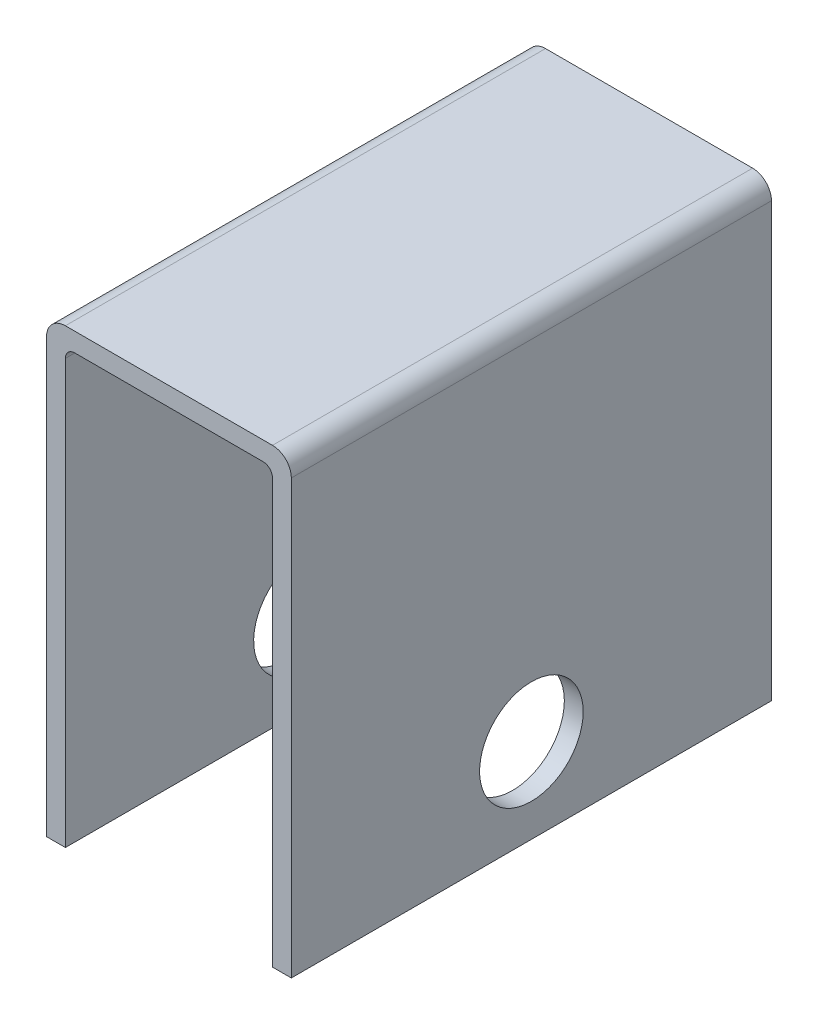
ISO-10303-21;
HEADER;
FILE_DESCRIPTION(('STEP AP214'),'2;1');
FILE_NAME('part.step','',(''),(''),'','','');
FILE_SCHEMA(('AUTOMOTIVE_DESIGN { 1 0 10303 214 1 1 1 1 }'));
ENDSEC;
DATA;
#1=APPLICATION_CONTEXT('core data for automotive mechanical design processes');
#2=APPLICATION_PROTOCOL_DEFINITION('international standard','automotive_design',2000,#1);
#3=PRODUCT_CONTEXT('',#1,'mechanical');
#4=PRODUCT('Part','Part','',(#3));
#5=PRODUCT_RELATED_PRODUCT_CATEGORY('part','',(#4));
#6=PRODUCT_DEFINITION_FORMATION('','',#4);
#7=PRODUCT_DEFINITION_CONTEXT('part definition',#1,'design');
#8=PRODUCT_DEFINITION('design','',#6,#7);
#9=PRODUCT_DEFINITION_SHAPE('','',#8);
#10=(LENGTH_UNIT() NAMED_UNIT(*) SI_UNIT(.MILLI.,.METRE.));
#11=(NAMED_UNIT(*) PLANE_ANGLE_UNIT() SI_UNIT($,.RADIAN.));
#12=(NAMED_UNIT(*) SI_UNIT($,.STERADIAN.) SOLID_ANGLE_UNIT());
#13=UNCERTAINTY_MEASURE_WITH_UNIT(LENGTH_MEASURE(1.E-05),#10,'distance_accuracy_value','');
#14=(GEOMETRIC_REPRESENTATION_CONTEXT(3) GLOBAL_UNCERTAINTY_ASSIGNED_CONTEXT((#13)) GLOBAL_UNIT_ASSIGNED_CONTEXT((#10,
#11,#12)) REPRESENTATION_CONTEXT('',''));
#15=CARTESIAN_POINT('',(0.,0.,0.));
#16=DIRECTION('',(0.,0.,1.));
#17=DIRECTION('',(1.,0.,0.));
#18=AXIS2_PLACEMENT_3D('',#15,#16,#17);
#19=CARTESIAN_POINT('',(0.,-240.,255.));
#20=DIRECTION('',(1.,0.,0.));
#21=DIRECTION('',(0.,0.,-1.));
#22=AXIS2_PLACEMENT_3D('',#19,#20,#21);
#23=PLANE('',#22);
#24=CARTESIAN_POINT('',(0.,-195.,127.5));
#25=DIRECTION('',(1.,0.,0.));
#26=DIRECTION('',(0.,0.,-1.));
#27=AXIS2_PLACEMENT_3D('',#24,#25,#26);
#28=CIRCLE('',#27,27.5);
#29=CARTESIAN_POINT('',(0.,-195.,100.));
#30=VERTEX_POINT('',#29);
#31=EDGE_CURVE('E258',#30,#30,#28,.T.);
#32=ORIENTED_EDGE('',*,*,#31,.T.);
#33=EDGE_LOOP('',(#32));
#34=FACE_BOUND('',#33,.T.);
#35=DIRECTION('',(0.,-1.,0.));
#36=VECTOR('',#35,1.);
#37=CARTESIAN_POINT('',(0.,-240.,255.));
#38=LINE('',#37,#36);
#39=CARTESIAN_POINT('',(0.,-10.,255.));
#40=VERTEX_POINT('',#39);
#41=CARTESIAN_POINT('',(0.,-240.,255.));
#42=VERTEX_POINT('',#41);
#43=EDGE_CURVE('E123',#40,#42,#38,.T.);
#44=ORIENTED_EDGE('',*,*,#43,.F.);
#45=DIRECTION('',(0.,0.,-1.));
#46=VECTOR('',#45,1.);
#47=CARTESIAN_POINT('',(0.,-10.,255.));
#48=LINE('',#47,#46);
#49=CARTESIAN_POINT('',(0.,-10.,0.));
#50=VERTEX_POINT('',#49);
#51=EDGE_CURVE('E148',#40,#50,#48,.T.);
#52=ORIENTED_EDGE('',*,*,#51,.T.);
#53=DIRECTION('',(0.,-1.,0.));
#54=VECTOR('',#53,1.);
#55=CARTESIAN_POINT('',(0.,-240.,0.));
#56=LINE('',#55,#54);
#57=CARTESIAN_POINT('',(0.,-240.,0.));
#58=VERTEX_POINT('',#57);
#59=EDGE_CURVE('E146',#50,#58,#56,.T.);
#60=ORIENTED_EDGE('',*,*,#59,.T.);
#61=DIRECTION('',(0.,0.,-1.));
#62=VECTOR('',#61,1.);
#63=CARTESIAN_POINT('',(0.,-240.,255.));
#64=LINE('',#63,#62);
#65=EDGE_CURVE('E140',#42,#58,#64,.T.);
#66=ORIENTED_EDGE('',*,*,#65,.F.);
#67=EDGE_LOOP('',(#44,#52,#60,#66));
#68=FACE_BOUND('',#67,.T.);
#69=ADVANCED_FACE('F35',(#34,#68),#23,.F.);
#70=CARTESIAN_POINT('',(10.,-240.,255.));
#71=DIRECTION('',(0.,1.,0.));
#72=DIRECTION('',(0.,0.,1.));
#73=AXIS2_PLACEMENT_3D('',#70,#71,#72);
#74=PLANE('',#73);
#75=DIRECTION('',(1.,0.,0.));
#76=VECTOR('',#75,1.);
#77=CARTESIAN_POINT('',(10.,-240.,0.));
#78=LINE('',#77,#76);
#79=CARTESIAN_POINT('',(10.,-240.,0.));
#80=VERTEX_POINT('',#79);
#81=EDGE_CURVE('E211',#58,#80,#78,.T.);
#82=ORIENTED_EDGE('',*,*,#81,.T.);
#83=DIRECTION('',(0.,0.,-1.));
#84=VECTOR('',#83,1.);
#85=CARTESIAN_POINT('',(10.,-240.,255.));
#86=LINE('',#85,#84);
#87=CARTESIAN_POINT('',(10.,-240.,255.));
#88=VERTEX_POINT('',#87);
#89=EDGE_CURVE('E142',#88,#80,#86,.T.);
#90=ORIENTED_EDGE('',*,*,#89,.F.);
#91=DIRECTION('',(1.,0.,0.));
#92=VECTOR('',#91,1.);
#93=CARTESIAN_POINT('',(10.,-240.,255.));
#94=LINE('',#93,#92);
#95=EDGE_CURVE('E127',#42,#88,#94,.T.);
#96=ORIENTED_EDGE('',*,*,#95,.F.);
#97=ORIENTED_EDGE('',*,*,#65,.T.);
#98=EDGE_LOOP('',(#82,#90,#96,#97));
#99=FACE_BOUND('',#98,.T.);
#100=ADVANCED_FACE('F139',(#99),#74,.F.);
#101=CARTESIAN_POINT('',(10.,-240.,255.));
#102=DIRECTION('',(-1.,0.,0.));
#103=DIRECTION('',(0.,-1.,0.));
#104=AXIS2_PLACEMENT_3D('',#101,#102,#103);
#105=PLANE('',#104);
#106=CARTESIAN_POINT('',(10.,-195.,127.5));
#107=DIRECTION('',(-1.,0.,0.));
#108=DIRECTION('',(0.,-1.,0.));
#109=AXIS2_PLACEMENT_3D('',#106,#107,#108);
#110=CIRCLE('',#109,27.5);
#111=CARTESIAN_POINT('',(10.,-222.5,127.5));
#112=VERTEX_POINT('',#111);
#113=EDGE_CURVE('E247',#112,#112,#110,.T.);
#114=ORIENTED_EDGE('',*,*,#113,.T.);
#115=EDGE_LOOP('',(#114));
#116=FACE_BOUND('',#115,.T.);
#117=DIRECTION('',(0.,1.,0.));
#118=VECTOR('',#117,1.);
#119=CARTESIAN_POINT('',(10.,-240.,0.));
#120=LINE('',#119,#118);
#121=CARTESIAN_POINT('',(10.,-15.,0.));
#122=VERTEX_POINT('',#121);
#123=EDGE_CURVE('E207',#80,#122,#120,.T.);
#124=ORIENTED_EDGE('',*,*,#123,.T.);
#125=DIRECTION('',(0.,0.,-1.));
#126=VECTOR('',#125,1.);
#127=CARTESIAN_POINT('',(10.,-15.,255.));
#128=LINE('',#127,#126);
#129=CARTESIAN_POINT('',(10.,-15.,255.));
#130=VERTEX_POINT('',#129);
#131=EDGE_CURVE('E50',#122,#130,#128,.F.);
#132=ORIENTED_EDGE('',*,*,#131,.T.);
#133=DIRECTION('',(0.,1.,0.));
#134=VECTOR('',#133,1.);
#135=CARTESIAN_POINT('',(10.,-240.,255.));
#136=LINE('',#135,#134);
#137=EDGE_CURVE('E143',#88,#130,#136,.T.);
#138=ORIENTED_EDGE('',*,*,#137,.F.);
#139=ORIENTED_EDGE('',*,*,#89,.T.);
#140=EDGE_LOOP('',(#124,#132,#138,#139));
#141=FACE_BOUND('',#140,.T.);
#142=ADVANCED_FACE('F248',(#116,#141),#105,.F.);
#143=CARTESIAN_POINT('',(120.,-10.,255.));
#144=DIRECTION('',(0.,1.,0.));
#145=DIRECTION('',(-1.,0.,0.));
#146=AXIS2_PLACEMENT_3D('',#143,#144,#145);
#147=PLANE('',#146);
#148=DIRECTION('',(1.,0.,0.));
#149=VECTOR('',#148,1.);
#150=CARTESIAN_POINT('',(120.,-10.,0.));
#151=LINE('',#150,#149);
#152=CARTESIAN_POINT('',(15.,-10.,0.));
#153=VERTEX_POINT('',#152);
#154=CARTESIAN_POINT('',(115.,-10.,0.));
#155=VERTEX_POINT('',#154);
#156=EDGE_CURVE('E201',#153,#155,#151,.T.);
#157=ORIENTED_EDGE('',*,*,#156,.T.);
#158=DIRECTION('',(0.,0.,-1.));
#159=VECTOR('',#158,1.);
#160=CARTESIAN_POINT('',(115.,-10.,255.));
#161=LINE('',#160,#159);
#162=CARTESIAN_POINT('',(115.,-10.,255.));
#163=VERTEX_POINT('',#162);
#164=EDGE_CURVE('E175',#155,#163,#161,.F.);
#165=ORIENTED_EDGE('',*,*,#164,.T.);
#166=DIRECTION('',(1.,0.,0.));
#167=VECTOR('',#166,1.);
#168=CARTESIAN_POINT('',(120.,-10.,255.));
#169=LINE('',#168,#167);
#170=CARTESIAN_POINT('',(15.,-10.,255.));
#171=VERTEX_POINT('',#170);
#172=EDGE_CURVE('E187',#171,#163,#169,.T.);
#173=ORIENTED_EDGE('',*,*,#172,.F.);
#174=DIRECTION('',(0.,0.,-1.));
#175=VECTOR('',#174,1.);
#176=CARTESIAN_POINT('',(15.,-10.,0.));
#177=LINE('',#176,#175);
#178=EDGE_CURVE('E172',#171,#153,#177,.T.);
#179=ORIENTED_EDGE('',*,*,#178,.T.);
#180=EDGE_LOOP('',(#157,#165,#173,#179));
#181=FACE_BOUND('',#180,.T.);
#182=ADVANCED_FACE('F205',(#181),#147,.F.);
#183=CARTESIAN_POINT('',(120.,-240.,255.));
#184=DIRECTION('',(1.,0.,0.));
#185=DIRECTION('',(0.,1.,0.));
#186=AXIS2_PLACEMENT_3D('',#183,#184,#185);
#187=PLANE('',#186);
#188=CARTESIAN_POINT('',(120.,-195.,127.5));
#189=DIRECTION('',(1.,0.,0.));
#190=DIRECTION('',(0.,1.,0.));
#191=AXIS2_PLACEMENT_3D('',#188,#189,#190);
#192=CIRCLE('',#191,27.5);
#193=CARTESIAN_POINT('',(120.,-167.5,127.5));
#194=VERTEX_POINT('',#193);
#195=EDGE_CURVE('E255',#194,#194,#192,.T.);
#196=ORIENTED_EDGE('',*,*,#195,.T.);
#197=EDGE_LOOP('',(#196));
#198=FACE_BOUND('',#197,.T.);
#199=DIRECTION('',(0.,-1.,0.));
#200=VECTOR('',#199,1.);
#201=CARTESIAN_POINT('',(120.,-240.,255.));
#202=LINE('',#201,#200);
#203=CARTESIAN_POINT('',(120.,-15.,255.));
#204=VERTEX_POINT('',#203);
#205=CARTESIAN_POINT('',(120.,-240.,255.));
#206=VERTEX_POINT('',#205);
#207=EDGE_CURVE('E184',#204,#206,#202,.T.);
#208=ORIENTED_EDGE('',*,*,#207,.F.);
#209=DIRECTION('',(0.,0.,-1.));
#210=VECTOR('',#209,1.);
#211=CARTESIAN_POINT('',(120.,-15.,0.));
#212=LINE('',#211,#210);
#213=CARTESIAN_POINT('',(120.,-15.,0.));
#214=VERTEX_POINT('',#213);
#215=EDGE_CURVE('E169',#204,#214,#212,.T.);
#216=ORIENTED_EDGE('',*,*,#215,.T.);
#217=DIRECTION('',(0.,-1.,0.));
#218=VECTOR('',#217,1.);
#219=CARTESIAN_POINT('',(120.,-240.,0.));
#220=LINE('',#219,#218);
#221=CARTESIAN_POINT('',(120.,-240.,0.));
#222=VERTEX_POINT('',#221);
#223=EDGE_CURVE('E203',#214,#222,#220,.T.);
#224=ORIENTED_EDGE('',*,*,#223,.T.);
#225=DIRECTION('',(0.,0.,-1.));
#226=VECTOR('',#225,1.);
#227=CARTESIAN_POINT('',(120.,-240.,255.));
#228=LINE('',#227,#226);
#229=EDGE_CURVE('E152',#206,#222,#228,.T.);
#230=ORIENTED_EDGE('',*,*,#229,.F.);
#231=EDGE_LOOP('',(#208,#216,#224,#230));
#232=FACE_BOUND('',#231,.T.);
#233=ADVANCED_FACE('F192',(#198,#232),#187,.F.);
#234=CARTESIAN_POINT('',(120.,-240.,255.));
#235=DIRECTION('',(0.,1.,0.));
#236=DIRECTION('',(0.,0.,1.));
#237=AXIS2_PLACEMENT_3D('',#234,#235,#236);
#238=PLANE('',#237);
#239=DIRECTION('',(1.,0.,0.));
#240=VECTOR('',#239,1.);
#241=CARTESIAN_POINT('',(120.,-240.,0.));
#242=LINE('',#241,#240);
#243=CARTESIAN_POINT('',(130.,-240.,0.));
#244=VERTEX_POINT('',#243);
#245=EDGE_CURVE('E209',#222,#244,#242,.T.);
#246=ORIENTED_EDGE('',*,*,#245,.T.);
#247=DIRECTION('',(0.,0.,-1.));
#248=VECTOR('',#247,1.);
#249=CARTESIAN_POINT('',(130.,-240.,255.));
#250=LINE('',#249,#248);
#251=CARTESIAN_POINT('',(130.,-240.,255.));
#252=VERTEX_POINT('',#251);
#253=EDGE_CURVE('E221',#252,#244,#250,.T.);
#254=ORIENTED_EDGE('',*,*,#253,.F.);
#255=DIRECTION('',(1.,0.,0.));
#256=VECTOR('',#255,1.);
#257=CARTESIAN_POINT('',(120.,-240.,255.));
#258=LINE('',#257,#256);
#259=EDGE_CURVE('E196',#206,#252,#258,.T.);
#260=ORIENTED_EDGE('',*,*,#259,.F.);
#261=ORIENTED_EDGE('',*,*,#229,.T.);
#262=EDGE_LOOP('',(#246,#254,#260,#261));
#263=FACE_BOUND('',#262,.T.);
#264=ADVANCED_FACE('F225',(#263),#238,.F.);
#265=CARTESIAN_POINT('',(130.,-240.,255.));
#266=DIRECTION('',(-1.,0.,0.));
#267=DIRECTION('',(0.,0.,1.));
#268=AXIS2_PLACEMENT_3D('',#265,#266,#267);
#269=PLANE('',#268);
#270=CARTESIAN_POINT('',(130.,-195.,127.5));
#271=DIRECTION('',(1.,0.,0.));
#272=DIRECTION('',(0.,0.,-1.));
#273=AXIS2_PLACEMENT_3D('',#270,#271,#272);
#274=CIRCLE('',#273,27.5);
#275=CARTESIAN_POINT('',(130.,-195.,100.));
#276=VERTEX_POINT('',#275);
#277=EDGE_CURVE('E259',#276,#276,#274,.T.);
#278=ORIENTED_EDGE('',*,*,#277,.F.);
#279=EDGE_LOOP('',(#278));
#280=FACE_BOUND('',#279,.T.);
#281=DIRECTION('',(0.,1.,0.));
#282=VECTOR('',#281,1.);
#283=CARTESIAN_POINT('',(130.,-240.,0.));
#284=LINE('',#283,#282);
#285=CARTESIAN_POINT('',(130.,-10.0000000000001,0.));
#286=VERTEX_POINT('',#285);
#287=EDGE_CURVE('E216',#244,#286,#284,.T.);
#288=ORIENTED_EDGE('',*,*,#287,.T.);
#289=DIRECTION('',(0.,0.,-1.));
#290=VECTOR('',#289,1.);
#291=CARTESIAN_POINT('',(130.,-10.,255.));
#292=LINE('',#291,#290);
#293=CARTESIAN_POINT('',(130.,-10.0000000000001,255.));
#294=VERTEX_POINT('',#293);
#295=EDGE_CURVE('E167',#286,#294,#292,.F.);
#296=ORIENTED_EDGE('',*,*,#295,.T.);
#297=DIRECTION('',(0.,1.,0.));
#298=VECTOR('',#297,1.);
#299=CARTESIAN_POINT('',(130.,-240.,255.));
#300=LINE('',#299,#298);
#301=EDGE_CURVE('E239',#252,#294,#300,.T.);
#302=ORIENTED_EDGE('',*,*,#301,.F.);
#303=ORIENTED_EDGE('',*,*,#253,.T.);
#304=EDGE_LOOP('',(#288,#296,#302,#303));
#305=FACE_BOUND('',#304,.T.);
#306=ADVANCED_FACE('F231',(#280,#305),#269,.F.);
#307=CARTESIAN_POINT('',(130.,0.,255.));
#308=DIRECTION('',(0.,-1.,0.));
#309=DIRECTION('',(1.,0.,0.));
#310=AXIS2_PLACEMENT_3D('',#307,#308,#309);
#311=PLANE('',#310);
#312=DIRECTION('',(-1.,0.,0.));
#313=VECTOR('',#312,1.);
#314=CARTESIAN_POINT('',(130.,0.,0.));
#315=LINE('',#314,#313);
#316=CARTESIAN_POINT('',(120.,0.,0.));
#317=VERTEX_POINT('',#316);
#318=CARTESIAN_POINT('',(10.,0.,0.));
#319=VERTEX_POINT('',#318);
#320=EDGE_CURVE('E135',#317,#319,#315,.T.);
#321=ORIENTED_EDGE('',*,*,#320,.T.);
#322=DIRECTION('',(0.,0.,-1.));
#323=VECTOR('',#322,1.);
#324=CARTESIAN_POINT('',(10.,0.,255.));
#325=LINE('',#324,#323);
#326=CARTESIAN_POINT('',(10.,0.,255.));
#327=VERTEX_POINT('',#326);
#328=EDGE_CURVE('E162',#319,#327,#325,.F.);
#329=ORIENTED_EDGE('',*,*,#328,.T.);
#330=DIRECTION('',(-1.,0.,0.));
#331=VECTOR('',#330,1.);
#332=CARTESIAN_POINT('',(130.,0.,255.));
#333=LINE('',#332,#331);
#334=CARTESIAN_POINT('',(120.,0.,255.));
#335=VERTEX_POINT('',#334);
#336=EDGE_CURVE('E223',#335,#327,#333,.T.);
#337=ORIENTED_EDGE('',*,*,#336,.F.);
#338=DIRECTION('',(0.,0.,-1.));
#339=VECTOR('',#338,1.);
#340=CARTESIAN_POINT('',(120.,0.,255.));
#341=LINE('',#340,#339);
#342=EDGE_CURVE('E159',#335,#317,#341,.T.);
#343=ORIENTED_EDGE('',*,*,#342,.T.);
#344=EDGE_LOOP('',(#321,#329,#337,#343));
#345=FACE_BOUND('',#344,.T.);
#346=ADVANCED_FACE('F241',(#345),#311,.F.);
#347=CARTESIAN_POINT('',(0.,0.,255.));
#348=DIRECTION('',(0.,0.,1.));
#349=DIRECTION('',(1.,0.,0.));
#350=AXIS2_PLACEMENT_3D('',#347,#348,#349);
#351=PLANE('',#350);
#352=ORIENTED_EDGE('',*,*,#336,.T.);
#353=CARTESIAN_POINT('',(10.,-10.,255.));
#354=DIRECTION('',(0.,0.,1.));
#355=DIRECTION('',(1.,0.,0.));
#356=AXIS2_PLACEMENT_3D('',#353,#354,#355);
#357=CIRCLE('',#356,10.);
#358=EDGE_CURVE('E130',#327,#40,#357,.T.);
#359=ORIENTED_EDGE('',*,*,#358,.T.);
#360=ORIENTED_EDGE('',*,*,#43,.T.);
#361=ORIENTED_EDGE('',*,*,#95,.T.);
#362=ORIENTED_EDGE('',*,*,#137,.T.);
#363=CARTESIAN_POINT('',(15.,-15.,255.));
#364=DIRECTION('',(0.,0.,1.));
#365=DIRECTION('',(1.,0.,0.));
#366=AXIS2_PLACEMENT_3D('',#363,#364,#365);
#367=CIRCLE('',#366,5.);
#368=EDGE_CURVE('E11',#130,#171,#367,.F.);
#369=ORIENTED_EDGE('',*,*,#368,.T.);
#370=ORIENTED_EDGE('',*,*,#172,.T.);
#371=CARTESIAN_POINT('',(115.,-15.,255.));
#372=DIRECTION('',(0.,0.,1.));
#373=DIRECTION('',(1.,0.,0.));
#374=AXIS2_PLACEMENT_3D('',#371,#372,#373);
#375=CIRCLE('',#374,5.);
#376=EDGE_CURVE('E180',#163,#204,#375,.F.);
#377=ORIENTED_EDGE('',*,*,#376,.T.);
#378=ORIENTED_EDGE('',*,*,#207,.T.);
#379=ORIENTED_EDGE('',*,*,#259,.T.);
#380=ORIENTED_EDGE('',*,*,#301,.T.);
#381=CARTESIAN_POINT('',(120.,-10.,255.));
#382=DIRECTION('',(0.,0.,1.));
#383=DIRECTION('',(1.,0.,0.));
#384=AXIS2_PLACEMENT_3D('',#381,#382,#383);
#385=CIRCLE('',#384,10.);
#386=EDGE_CURVE('E164',#294,#335,#385,.T.);
#387=ORIENTED_EDGE('',*,*,#386,.T.);
#388=EDGE_LOOP('',(#352,#359,#360,#361,#362,#369,#370,#377,#378,#379,#380,#387));
#389=FACE_BOUND('',#388,.T.);
#390=ADVANCED_FACE('F126',(#389),#351,.T.);
#391=CARTESIAN_POINT('',(0.,0.,0.));
#392=DIRECTION('',(0.,0.,1.));
#393=DIRECTION('',(1.,0.,0.));
#394=AXIS2_PLACEMENT_3D('',#391,#392,#393);
#395=PLANE('',#394);
#396=ORIENTED_EDGE('',*,*,#59,.F.);
#397=CARTESIAN_POINT('',(10.,-10.,0.));
#398=DIRECTION('',(0.,0.,1.));
#399=DIRECTION('',(1.,0.,0.));
#400=AXIS2_PLACEMENT_3D('',#397,#398,#399);
#401=CIRCLE('',#400,10.);
#402=EDGE_CURVE('E157',#50,#319,#401,.F.);
#403=ORIENTED_EDGE('',*,*,#402,.T.);
#404=ORIENTED_EDGE('',*,*,#320,.F.);
#405=CARTESIAN_POINT('',(120.,-10.,0.));
#406=DIRECTION('',(0.,0.,1.));
#407=DIRECTION('',(1.,0.,0.));
#408=AXIS2_PLACEMENT_3D('',#405,#406,#407);
#409=CIRCLE('',#408,10.);
#410=EDGE_CURVE('E150',#317,#286,#409,.F.);
#411=ORIENTED_EDGE('',*,*,#410,.T.);
#412=ORIENTED_EDGE('',*,*,#287,.F.);
#413=ORIENTED_EDGE('',*,*,#245,.F.);
#414=ORIENTED_EDGE('',*,*,#223,.F.);
#415=CARTESIAN_POINT('',(115.,-15.,0.));
#416=DIRECTION('',(0.,0.,1.));
#417=DIRECTION('',(1.,0.,0.));
#418=AXIS2_PLACEMENT_3D('',#415,#416,#417);
#419=CIRCLE('',#418,5.);
#420=EDGE_CURVE('E178',#214,#155,#419,.T.);
#421=ORIENTED_EDGE('',*,*,#420,.T.);
#422=ORIENTED_EDGE('',*,*,#156,.F.);
#423=CARTESIAN_POINT('',(15.,-15.,0.));
#424=DIRECTION('',(0.,0.,1.));
#425=DIRECTION('',(1.,0.,0.));
#426=AXIS2_PLACEMENT_3D('',#423,#424,#425);
#427=CIRCLE('',#426,5.);
#428=EDGE_CURVE('E43',#153,#122,#427,.T.);
#429=ORIENTED_EDGE('',*,*,#428,.T.);
#430=ORIENTED_EDGE('',*,*,#123,.F.);
#431=ORIENTED_EDGE('',*,*,#81,.F.);
#432=EDGE_LOOP('',(#396,#403,#404,#411,#412,#413,#414,#421,#422,#429,#430,#431));
#433=FACE_BOUND('',#432,.T.);
#434=ADVANCED_FACE('F200',(#433),#395,.F.);
#435=CARTESIAN_POINT('',(0.,-195.,127.5));
#436=DIRECTION('',(1.,0.,0.));
#437=DIRECTION('',(0.,0.,-1.));
#438=AXIS2_PLACEMENT_3D('',#435,#436,#437);
#439=CYLINDRICAL_SURFACE('',#438,27.5);
#440=ORIENTED_EDGE('',*,*,#277,.T.);
#441=EDGE_LOOP('',(#440));
#442=FACE_BOUND('',#441,.T.);
#443=ORIENTED_EDGE('',*,*,#195,.F.);
#444=EDGE_LOOP('',(#443));
#445=FACE_BOUND('',#444,.T.);
#446=ADVANCED_FACE('F270',(#442,#445),#439,.F.);
#447=ORIENTED_EDGE('',*,*,#31,.F.);
#448=EDGE_LOOP('',(#447));
#449=FACE_BOUND('',#448,.T.);
#450=ORIENTED_EDGE('',*,*,#113,.F.);
#451=EDGE_LOOP('',(#450));
#452=FACE_BOUND('',#451,.T.);
#453=ADVANCED_FACE('F266',(#449,#452),#439,.F.);
#454=CARTESIAN_POINT('',(10.,-10.,255.));
#455=DIRECTION('',(0.,0.,-1.));
#456=DIRECTION('',(-1.,0.,0.));
#457=AXIS2_PLACEMENT_3D('',#454,#455,#456);
#458=CYLINDRICAL_SURFACE('',#457,10.);
#459=ORIENTED_EDGE('',*,*,#358,.F.);
#460=ORIENTED_EDGE('',*,*,#328,.F.);
#461=ORIENTED_EDGE('',*,*,#402,.F.);
#462=ORIENTED_EDGE('',*,*,#51,.F.);
#463=EDGE_LOOP('',(#459,#460,#461,#462));
#464=FACE_BOUND('',#463,.T.);
#465=ADVANCED_FACE('F269',(#464),#458,.T.);
#466=CARTESIAN_POINT('',(120.,-10.,255.));
#467=DIRECTION('',(0.,0.,-1.));
#468=DIRECTION('',(-1.,0.,0.));
#469=AXIS2_PLACEMENT_3D('',#466,#467,#468);
#470=CYLINDRICAL_SURFACE('',#469,10.);
#471=ORIENTED_EDGE('',*,*,#386,.F.);
#472=ORIENTED_EDGE('',*,*,#295,.F.);
#473=ORIENTED_EDGE('',*,*,#410,.F.);
#474=ORIENTED_EDGE('',*,*,#342,.F.);
#475=EDGE_LOOP('',(#471,#472,#473,#474));
#476=FACE_BOUND('',#475,.T.);
#477=ADVANCED_FACE('F236',(#476),#470,.T.);
#478=CARTESIAN_POINT('',(115.,-15.,255.));
#479=DIRECTION('',(0.,0.,1.));
#480=DIRECTION('',(1.,0.,0.));
#481=AXIS2_PLACEMENT_3D('',#478,#479,#480);
#482=CYLINDRICAL_SURFACE('',#481,5.);
#483=ORIENTED_EDGE('',*,*,#376,.F.);
#484=ORIENTED_EDGE('',*,*,#164,.F.);
#485=ORIENTED_EDGE('',*,*,#420,.F.);
#486=ORIENTED_EDGE('',*,*,#215,.F.);
#487=EDGE_LOOP('',(#483,#484,#485,#486));
#488=FACE_BOUND('',#487,.T.);
#489=ADVANCED_FACE('F198',(#488),#482,.F.);
#490=CARTESIAN_POINT('',(15.,-15.,255.));
#491=DIRECTION('',(0.,0.,1.));
#492=DIRECTION('',(1.,0.,0.));
#493=AXIS2_PLACEMENT_3D('',#490,#491,#492);
#494=CYLINDRICAL_SURFACE('',#493,5.);
#495=ORIENTED_EDGE('',*,*,#368,.F.);
#496=ORIENTED_EDGE('',*,*,#131,.F.);
#497=ORIENTED_EDGE('',*,*,#428,.F.);
#498=ORIENTED_EDGE('',*,*,#178,.F.);
#499=EDGE_LOOP('',(#495,#496,#497,#498));
#500=FACE_BOUND('',#499,.T.);
#501=ADVANCED_FACE('F37',(#500),#494,.F.);
#502=CLOSED_SHELL('',(#69,#100,#142,#182,#233,#264,#306,#346,#390,#434,#446,#453,#465,#477,#489,#501));
#503=MANIFOLD_SOLID_BREP('B2',#502);
#504=ADVANCED_BREP_SHAPE_REPRESENTATION('',(#18,#503),#14);
#505=SHAPE_DEFINITION_REPRESENTATION(#9,#504);
ENDSEC;
END-ISO-10303-21;
